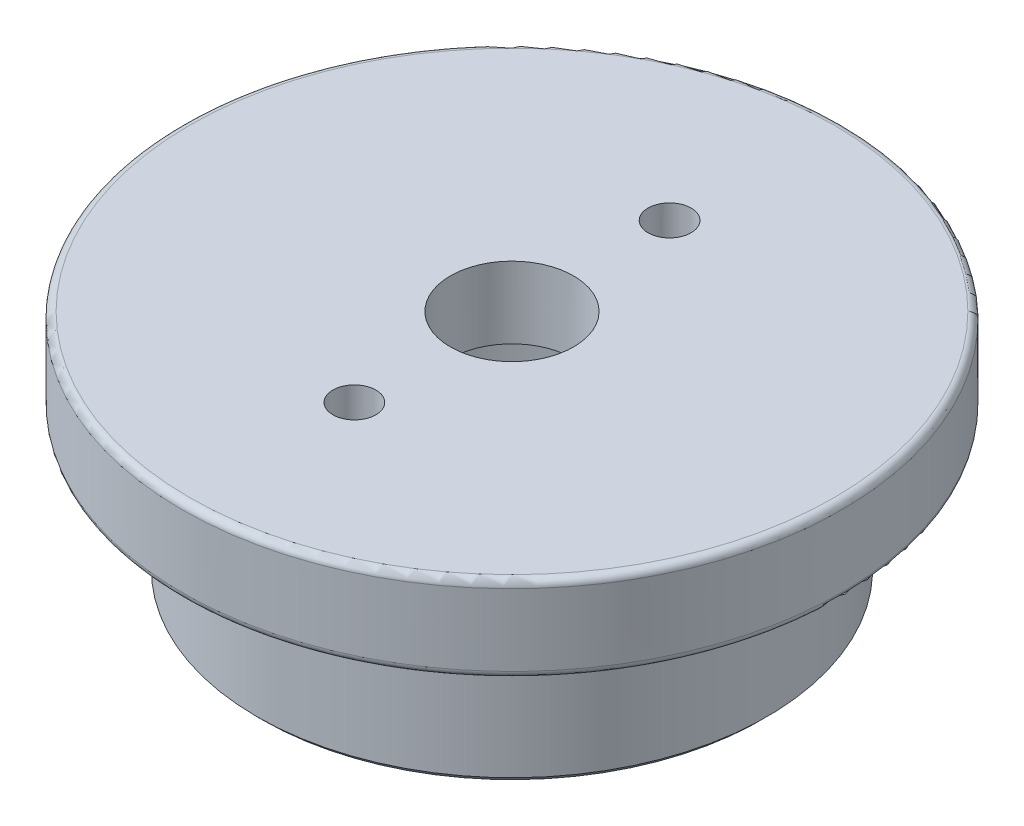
ISO-10303-21;
HEADER;
FILE_DESCRIPTION(('STEP AP214'),'2;1');
FILE_NAME('part.step','',(''),(''),'','','');
FILE_SCHEMA(('AUTOMOTIVE_DESIGN { 1 0 10303 214 1 1 1 1 }'));
ENDSEC;
DATA;
#1=APPLICATION_CONTEXT('core data for automotive mechanical design processes');
#2=APPLICATION_PROTOCOL_DEFINITION('international standard','automotive_design',2000,#1);
#3=PRODUCT_CONTEXT('',#1,'mechanical');
#4=PRODUCT('Part','Part','',(#3));
#5=PRODUCT_RELATED_PRODUCT_CATEGORY('part','',(#4));
#6=PRODUCT_DEFINITION_FORMATION('','',#4);
#7=PRODUCT_DEFINITION_CONTEXT('part definition',#1,'design');
#8=PRODUCT_DEFINITION('design','',#6,#7);
#9=PRODUCT_DEFINITION_SHAPE('','',#8);
#10=(LENGTH_UNIT() NAMED_UNIT(*) SI_UNIT(.MILLI.,.METRE.));
#11=(NAMED_UNIT(*) PLANE_ANGLE_UNIT() SI_UNIT($,.RADIAN.));
#12=(NAMED_UNIT(*) SI_UNIT($,.STERADIAN.) SOLID_ANGLE_UNIT());
#13=UNCERTAINTY_MEASURE_WITH_UNIT(LENGTH_MEASURE(1.E-05),#10,'distance_accuracy_value','');
#14=(GEOMETRIC_REPRESENTATION_CONTEXT(3) GLOBAL_UNCERTAINTY_ASSIGNED_CONTEXT((#13)) GLOBAL_UNIT_ASSIGNED_CONTEXT((#10,
#11,#12)) REPRESENTATION_CONTEXT('',''));
#15=CARTESIAN_POINT('',(0.,0.,0.));
#16=DIRECTION('',(0.,0.,1.));
#17=DIRECTION('',(1.,0.,0.));
#18=AXIS2_PLACEMENT_3D('',#15,#16,#17);
#19=CARTESIAN_POINT('',(0.,8.,0.));
#20=DIRECTION('',(0.,1.,0.));
#21=DIRECTION('',(0.,0.,1.));
#22=AXIS2_PLACEMENT_3D('',#19,#20,#21);
#23=CYLINDRICAL_SURFACE('',#22,2.15);
#24=CARTESIAN_POINT('',(0.,8.,0.));
#25=DIRECTION('',(0.,1.,0.));
#26=DIRECTION('',(0.,0.,1.));
#27=AXIS2_PLACEMENT_3D('',#24,#25,#26);
#28=CIRCLE('',#27,2.15);
#29=CARTESIAN_POINT('',(0.,8.,2.15));
#30=VERTEX_POINT('',#29);
#31=EDGE_CURVE('E68',#30,#30,#28,.T.);
#32=ORIENTED_EDGE('',*,*,#31,.T.);
#33=EDGE_LOOP('',(#32));
#34=FACE_BOUND('',#33,.T.);
#35=CARTESIAN_POINT('',(0.,5.5,0.));
#36=DIRECTION('',(0.,-1.,0.));
#37=DIRECTION('',(0.,0.,-1.));
#38=AXIS2_PLACEMENT_3D('',#35,#36,#37);
#39=CIRCLE('',#38,2.15);
#40=CARTESIAN_POINT('',(0.,5.5,-2.15));
#41=VERTEX_POINT('',#40);
#42=EDGE_CURVE('E65',#41,#41,#39,.F.);
#43=ORIENTED_EDGE('',*,*,#42,.F.);
#44=EDGE_LOOP('',(#43));
#45=FACE_BOUND('',#44,.T.);
#46=ADVANCED_FACE('F34',(#34,#45),#23,.F.);
#47=CARTESIAN_POINT('',(11.5,8.,0.));
#48=DIRECTION('',(0.,1.,0.));
#49=DIRECTION('',(0.,0.,1.));
#50=AXIS2_PLACEMENT_3D('',#47,#48,#49);
#51=PLANE('',#50);
#52=CARTESIAN_POINT('',(0.,8.,5.5));
#53=DIRECTION('',(0.,1.,0.));
#54=DIRECTION('',(0.,0.,1.));
#55=AXIS2_PLACEMENT_3D('',#52,#53,#54);
#56=CIRCLE('',#55,0.749999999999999);
#57=CARTESIAN_POINT('',(0.,8.,6.25));
#58=VERTEX_POINT('',#57);
#59=EDGE_CURVE('E60',#58,#58,#56,.T.);
#60=ORIENTED_EDGE('',*,*,#59,.F.);
#61=EDGE_LOOP('',(#60));
#62=FACE_BOUND('',#61,.T.);
#63=CARTESIAN_POINT('',(0.,8.,-5.5));
#64=DIRECTION('',(0.,1.,0.));
#65=DIRECTION('',(0.,0.,1.));
#66=AXIS2_PLACEMENT_3D('',#63,#64,#65);
#67=CIRCLE('',#66,0.749999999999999);
#68=CARTESIAN_POINT('',(0.,8.,-4.75));
#69=VERTEX_POINT('',#68);
#70=EDGE_CURVE('E59',#69,#69,#67,.T.);
#71=ORIENTED_EDGE('',*,*,#70,.F.);
#72=EDGE_LOOP('',(#71));
#73=FACE_BOUND('',#72,.T.);
#74=CARTESIAN_POINT('',(0.,8.,0.));
#75=DIRECTION('',(0.,1.,0.));
#76=DIRECTION('',(0.,0.,1.));
#77=AXIS2_PLACEMENT_3D('',#74,#75,#76);
#78=CIRCLE('',#77,11.25);
#79=CARTESIAN_POINT('',(0.,8.,11.25));
#80=VERTEX_POINT('',#79);
#81=EDGE_CURVE('E71',#80,#80,#78,.T.);
#82=ORIENTED_EDGE('',*,*,#81,.T.);
#83=EDGE_LOOP('',(#82));
#84=FACE_BOUND('',#83,.T.);
#85=ORIENTED_EDGE('',*,*,#31,.F.);
#86=EDGE_LOOP('',(#85));
#87=FACE_BOUND('',#86,.T.);
#88=ADVANCED_FACE('F94',(#62,#73,#84,#87),#51,.T.);
#89=CARTESIAN_POINT('',(0.,0.,0.));
#90=DIRECTION('',(0.,-1.,0.));
#91=DIRECTION('',(0.,0.,-1.));
#92=AXIS2_PLACEMENT_3D('',#89,#90,#91);
#93=PLANE('',#92);
#94=CARTESIAN_POINT('',(0.,0.,0.));
#95=DIRECTION('',(0.,-1.,0.));
#96=DIRECTION('',(0.,0.,-1.));
#97=AXIS2_PLACEMENT_3D('',#94,#95,#96);
#98=CIRCLE('',#97,8.69999999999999);
#99=CARTESIAN_POINT('',(0.,0.,-8.69999999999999));
#100=VERTEX_POINT('',#99);
#101=EDGE_CURVE('E46',#100,#100,#98,.T.);
#102=ORIENTED_EDGE('',*,*,#101,.T.);
#103=EDGE_LOOP('',(#102));
#104=FACE_BOUND('',#103,.T.);
#105=CARTESIAN_POINT('',(0.,0.,0.));
#106=DIRECTION('',(0.,-1.,0.));
#107=DIRECTION('',(0.,0.,-1.));
#108=AXIS2_PLACEMENT_3D('',#105,#106,#107);
#109=CIRCLE('',#108,7.30000000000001);
#110=CARTESIAN_POINT('',(0.,0.,-7.30000000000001));
#111=VERTEX_POINT('',#110);
#112=EDGE_CURVE('E50',#111,#111,#109,.F.);
#113=ORIENTED_EDGE('',*,*,#112,.T.);
#114=EDGE_LOOP('',(#113));
#115=FACE_BOUND('',#114,.T.);
#116=ADVANCED_FACE('F97',(#104,#115),#93,.T.);
#117=CARTESIAN_POINT('',(0.,0.,0.));
#118=DIRECTION('',(0.,-1.,0.));
#119=DIRECTION('',(0.,0.,-1.));
#120=AXIS2_PLACEMENT_3D('',#117,#118,#119);
#121=CYLINDRICAL_SURFACE('',#120,8.9);
#122=CARTESIAN_POINT('',(0.,0.200000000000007,0.));
#123=DIRECTION('',(0.,-1.,0.));
#124=DIRECTION('',(0.,0.,-1.));
#125=AXIS2_PLACEMENT_3D('',#122,#123,#124);
#126=CIRCLE('',#125,8.9);
#127=CARTESIAN_POINT('',(0.,0.200000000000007,-8.9));
#128=VERTEX_POINT('',#127);
#129=EDGE_CURVE('E42',#128,#128,#126,.F.);
#130=ORIENTED_EDGE('',*,*,#129,.T.);
#131=EDGE_LOOP('',(#130));
#132=FACE_BOUND('',#131,.T.);
#133=CARTESIAN_POINT('',(0.,5.,0.));
#134=DIRECTION('',(0.,-1.,0.));
#135=DIRECTION('',(0.,0.,-1.));
#136=AXIS2_PLACEMENT_3D('',#133,#134,#135);
#137=CIRCLE('',#136,8.9);
#138=CARTESIAN_POINT('',(0.,5.,-8.9));
#139=VERTEX_POINT('',#138);
#140=EDGE_CURVE('E80',#139,#139,#137,.T.);
#141=ORIENTED_EDGE('',*,*,#140,.T.);
#142=EDGE_LOOP('',(#141));
#143=FACE_BOUND('',#142,.T.);
#144=ADVANCED_FACE('F137',(#132,#143),#121,.T.);
#145=CARTESIAN_POINT('',(8.9,5.,0.));
#146=DIRECTION('',(0.,-1.,0.));
#147=DIRECTION('',(0.,0.,-1.));
#148=AXIS2_PLACEMENT_3D('',#145,#146,#147);
#149=PLANE('',#148);
#150=CARTESIAN_POINT('',(0.,5.,0.));
#151=DIRECTION('',(0.,-1.,0.));
#152=DIRECTION('',(0.,0.,-1.));
#153=AXIS2_PLACEMENT_3D('',#150,#151,#152);
#154=CIRCLE('',#153,11.25);
#155=CARTESIAN_POINT('',(0.,5.,-11.25));
#156=VERTEX_POINT('',#155);
#157=EDGE_CURVE('E55',#156,#156,#154,.T.);
#158=ORIENTED_EDGE('',*,*,#157,.T.);
#159=EDGE_LOOP('',(#158));
#160=FACE_BOUND('',#159,.T.);
#161=ORIENTED_EDGE('',*,*,#140,.F.);
#162=EDGE_LOOP('',(#161));
#163=FACE_BOUND('',#162,.T.);
#164=ADVANCED_FACE('F133',(#160,#163),#149,.T.);
#165=CARTESIAN_POINT('',(0.,0.,0.));
#166=DIRECTION('',(0.,-1.,0.));
#167=DIRECTION('',(0.,0.,-1.));
#168=AXIS2_PLACEMENT_3D('',#165,#166,#167);
#169=CYLINDRICAL_SURFACE('',#168,11.5);
#170=CARTESIAN_POINT('',(0.,7.75,0.));
#171=DIRECTION('',(0.,1.,0.));
#172=DIRECTION('',(0.,0.,1.));
#173=AXIS2_PLACEMENT_3D('',#170,#171,#172);
#174=CIRCLE('',#173,11.5);
#175=CARTESIAN_POINT('',(0.,7.75,11.5));
#176=VERTEX_POINT('',#175);
#177=EDGE_CURVE('E74',#176,#176,#174,.F.);
#178=ORIENTED_EDGE('',*,*,#177,.T.);
#179=EDGE_LOOP('',(#178));
#180=FACE_BOUND('',#179,.T.);
#181=CARTESIAN_POINT('',(0.,5.25,0.));
#182=DIRECTION('',(0.,-1.,0.));
#183=DIRECTION('',(0.,0.,-1.));
#184=AXIS2_PLACEMENT_3D('',#181,#182,#183);
#185=CIRCLE('',#184,11.5);
#186=CARTESIAN_POINT('',(0.,5.25,-11.5));
#187=VERTEX_POINT('',#186);
#188=EDGE_CURVE('E77',#187,#187,#185,.F.);
#189=ORIENTED_EDGE('',*,*,#188,.T.);
#190=EDGE_LOOP('',(#189));
#191=FACE_BOUND('',#190,.T.);
#192=ADVANCED_FACE('F130',(#180,#191),#169,.T.);
#193=CARTESIAN_POINT('',(0.,7.75,0.));
#194=DIRECTION('',(0.,1.,0.));
#195=DIRECTION('',(0.,0.,1.));
#196=AXIS2_PLACEMENT_3D('',#193,#194,#195);
#197=TOROIDAL_SURFACE('',#196,11.25,0.25);
#198=ORIENTED_EDGE('',*,*,#81,.F.);
#199=EDGE_LOOP('',(#198));
#200=FACE_BOUND('',#199,.T.);
#201=ORIENTED_EDGE('',*,*,#177,.F.);
#202=EDGE_LOOP('',(#201));
#203=FACE_BOUND('',#202,.T.);
#204=ADVANCED_FACE('F122',(#200,#203),#197,.T.);
#205=CARTESIAN_POINT('',(0.,5.25,0.));
#206=DIRECTION('',(0.,-1.,0.));
#207=DIRECTION('',(0.,0.,-1.));
#208=AXIS2_PLACEMENT_3D('',#205,#206,#207);
#209=TOROIDAL_SURFACE('',#208,11.25,0.25);
#210=ORIENTED_EDGE('',*,*,#188,.F.);
#211=EDGE_LOOP('',(#210));
#212=FACE_BOUND('',#211,.T.);
#213=ORIENTED_EDGE('',*,*,#157,.F.);
#214=EDGE_LOOP('',(#213));
#215=FACE_BOUND('',#214,.T.);
#216=ADVANCED_FACE('F113',(#212,#215),#209,.T.);
#217=CARTESIAN_POINT('',(0.,5.5,0.));
#218=DIRECTION('',(0.,-1.,0.));
#219=DIRECTION('',(0.,0.,-1.));
#220=AXIS2_PLACEMENT_3D('',#217,#218,#219);
#221=PLANE('',#220);
#222=CARTESIAN_POINT('',(0.,5.5,5.5));
#223=DIRECTION('',(0.,-1.,0.));
#224=DIRECTION('',(0.,0.,-1.));
#225=AXIS2_PLACEMENT_3D('',#222,#223,#224);
#226=CIRCLE('',#225,0.749999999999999);
#227=CARTESIAN_POINT('',(0.,5.5,4.75));
#228=VERTEX_POINT('',#227);
#229=EDGE_CURVE('E56',#228,#228,#226,.T.);
#230=ORIENTED_EDGE('',*,*,#229,.F.);
#231=EDGE_LOOP('',(#230));
#232=FACE_BOUND('',#231,.T.);
#233=CARTESIAN_POINT('',(0.,5.5,-5.5));
#234=DIRECTION('',(0.,-1.,0.));
#235=DIRECTION('',(0.,0.,-1.));
#236=AXIS2_PLACEMENT_3D('',#233,#234,#235);
#237=CIRCLE('',#236,0.749999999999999);
#238=CARTESIAN_POINT('',(0.,5.5,-6.25));
#239=VERTEX_POINT('',#238);
#240=EDGE_CURVE('E61',#239,#239,#237,.T.);
#241=ORIENTED_EDGE('',*,*,#240,.F.);
#242=EDGE_LOOP('',(#241));
#243=FACE_BOUND('',#242,.T.);
#244=CARTESIAN_POINT('',(0.,5.5,0.));
#245=DIRECTION('',(0.,-1.,0.));
#246=DIRECTION('',(0.,0.,-1.));
#247=AXIS2_PLACEMENT_3D('',#244,#245,#246);
#248=CIRCLE('',#247,7.1);
#249=CARTESIAN_POINT('',(0.,5.5,-7.1));
#250=VERTEX_POINT('',#249);
#251=EDGE_CURVE('E64',#250,#250,#248,.T.);
#252=ORIENTED_EDGE('',*,*,#251,.T.);
#253=EDGE_LOOP('',(#252));
#254=FACE_BOUND('',#253,.T.);
#255=ORIENTED_EDGE('',*,*,#42,.T.);
#256=EDGE_LOOP('',(#255));
#257=FACE_BOUND('',#256,.T.);
#258=ADVANCED_FACE('F110',(#232,#243,#254,#257),#221,.T.);
#259=CARTESIAN_POINT('',(0.,5.5,0.));
#260=DIRECTION('',(0.,-1.,0.));
#261=DIRECTION('',(0.,0.,-1.));
#262=AXIS2_PLACEMENT_3D('',#259,#260,#261);
#263=CYLINDRICAL_SURFACE('',#262,7.1);
#264=CARTESIAN_POINT('',(0.,0.200000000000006,0.));
#265=DIRECTION('',(0.,-1.,0.));
#266=DIRECTION('',(0.,0.,-1.));
#267=AXIS2_PLACEMENT_3D('',#264,#265,#266);
#268=CIRCLE('',#267,7.1);
#269=CARTESIAN_POINT('',(0.,0.200000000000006,-7.1));
#270=VERTEX_POINT('',#269);
#271=EDGE_CURVE('E10',#270,#270,#268,.T.);
#272=ORIENTED_EDGE('',*,*,#271,.T.);
#273=EDGE_LOOP('',(#272));
#274=FACE_BOUND('',#273,.T.);
#275=ORIENTED_EDGE('',*,*,#251,.F.);
#276=EDGE_LOOP('',(#275));
#277=FACE_BOUND('',#276,.T.);
#278=ADVANCED_FACE('F112',(#274,#277),#263,.F.);
#279=CARTESIAN_POINT('',(0.,8.,-5.5));
#280=DIRECTION('',(0.,1.,0.));
#281=DIRECTION('',(0.,0.,1.));
#282=AXIS2_PLACEMENT_3D('',#279,#280,#281);
#283=CYLINDRICAL_SURFACE('',#282,0.749999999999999);
#284=ORIENTED_EDGE('',*,*,#240,.T.);
#285=EDGE_LOOP('',(#284));
#286=FACE_BOUND('',#285,.T.);
#287=ORIENTED_EDGE('',*,*,#70,.T.);
#288=EDGE_LOOP('',(#287));
#289=FACE_BOUND('',#288,.T.);
#290=ADVANCED_FACE('F120',(#286,#289),#283,.F.);
#291=CARTESIAN_POINT('',(0.,8.,5.5));
#292=DIRECTION('',(0.,1.,0.));
#293=DIRECTION('',(0.,0.,1.));
#294=AXIS2_PLACEMENT_3D('',#291,#292,#293);
#295=CYLINDRICAL_SURFACE('',#294,0.749999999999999);
#296=ORIENTED_EDGE('',*,*,#229,.T.);
#297=EDGE_LOOP('',(#296));
#298=FACE_BOUND('',#297,.T.);
#299=ORIENTED_EDGE('',*,*,#59,.T.);
#300=EDGE_LOOP('',(#299));
#301=FACE_BOUND('',#300,.T.);
#302=ADVANCED_FACE('F92',(#298,#301),#295,.F.);
#303=CARTESIAN_POINT('',(0.,0.,0.));
#304=DIRECTION('',(0.,1.,0.));
#305=DIRECTION('',(0.,0.,1.));
#306=AXIS2_PLACEMENT_3D('',#303,#304,#305);
#307=CONICAL_SURFACE('',#306,8.69999999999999,0.785398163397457);
#308=ORIENTED_EDGE('',*,*,#129,.F.);
#309=EDGE_LOOP('',(#308));
#310=FACE_BOUND('',#309,.T.);
#311=ORIENTED_EDGE('',*,*,#101,.F.);
#312=EDGE_LOOP('',(#311));
#313=FACE_BOUND('',#312,.T.);
#314=ADVANCED_FACE('F147',(#310,#313),#307,.T.);
#315=CARTESIAN_POINT('',(0.,0.200000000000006,0.));
#316=DIRECTION('',(0.,-1.,0.));
#317=DIRECTION('',(0.,0.,-1.));
#318=AXIS2_PLACEMENT_3D('',#315,#316,#317);
#319=CONICAL_SURFACE('',#318,7.1,0.785398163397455);
#320=ORIENTED_EDGE('',*,*,#112,.F.);
#321=EDGE_LOOP('',(#320));
#322=FACE_BOUND('',#321,.T.);
#323=ORIENTED_EDGE('',*,*,#271,.F.);
#324=EDGE_LOOP('',(#323));
#325=FACE_BOUND('',#324,.T.);
#326=ADVANCED_FACE('F37',(#322,#325),#319,.F.);
#327=CLOSED_SHELL('',(#46,#88,#116,#144,#164,#192,#204,#216,#258,#278,#290,#302,#314,#326));
#328=MANIFOLD_SOLID_BREP('B2',#327);
#329=ADVANCED_BREP_SHAPE_REPRESENTATION('',(#18,#328),#14);
#330=SHAPE_DEFINITION_REPRESENTATION(#9,#329);
ENDSEC;
END-ISO-10303-21;
